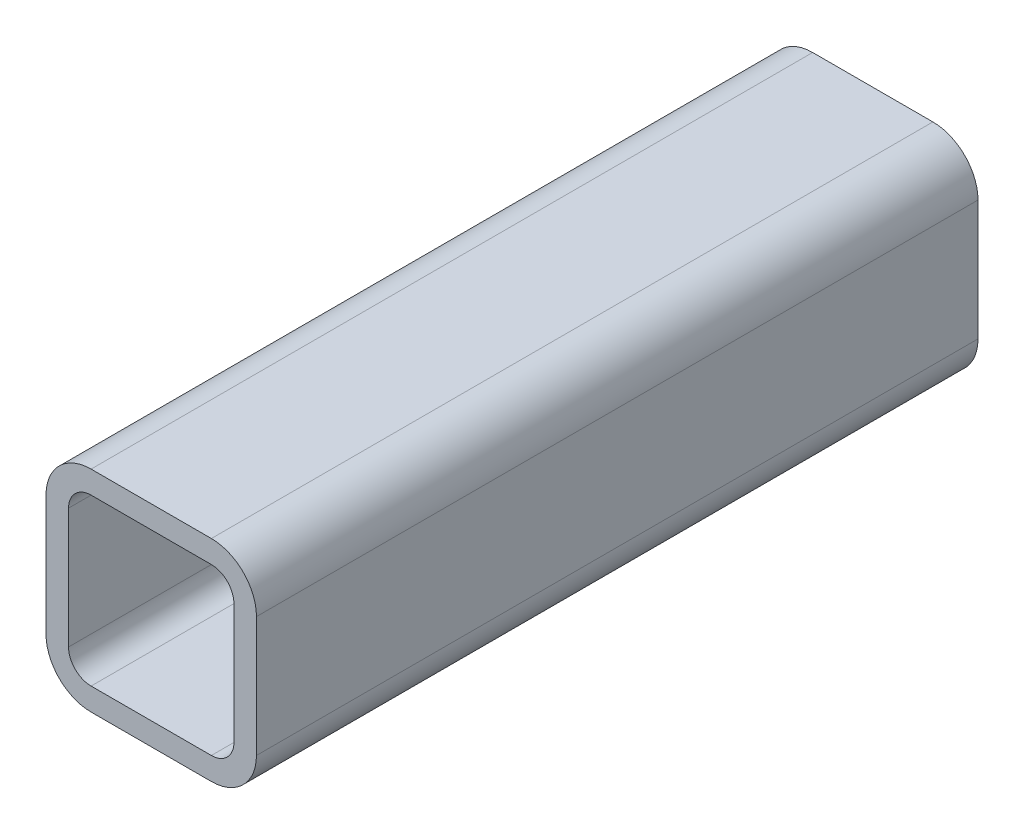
ISO-10303-21;
HEADER;
FILE_DESCRIPTION(('STEP AP214'),'2;1');
FILE_NAME('part.step','',(''),(''),'','','');
FILE_SCHEMA(('AUTOMOTIVE_DESIGN { 1 0 10303 214 1 1 1 1 }'));
ENDSEC;
DATA;
#1=APPLICATION_CONTEXT('core data for automotive mechanical design processes');
#2=APPLICATION_PROTOCOL_DEFINITION('international standard','automotive_design',2000,#1);
#3=PRODUCT_CONTEXT('',#1,'mechanical');
#4=PRODUCT('Part','Part','',(#3));
#5=PRODUCT_RELATED_PRODUCT_CATEGORY('part','',(#4));
#6=PRODUCT_DEFINITION_FORMATION('','',#4);
#7=PRODUCT_DEFINITION_CONTEXT('part definition',#1,'design');
#8=PRODUCT_DEFINITION('design','',#6,#7);
#9=PRODUCT_DEFINITION_SHAPE('','',#8);
#10=(LENGTH_UNIT() NAMED_UNIT(*) SI_UNIT(.MILLI.,.METRE.));
#11=(NAMED_UNIT(*) PLANE_ANGLE_UNIT() SI_UNIT($,.RADIAN.));
#12=(NAMED_UNIT(*) SI_UNIT($,.STERADIAN.) SOLID_ANGLE_UNIT());
#13=UNCERTAINTY_MEASURE_WITH_UNIT(LENGTH_MEASURE(1.E-05),#10,'distance_accuracy_value','');
#14=(GEOMETRIC_REPRESENTATION_CONTEXT(3) GLOBAL_UNCERTAINTY_ASSIGNED_CONTEXT((#13)) GLOBAL_UNIT_ASSIGNED_CONTEXT((#10,
#11,#12)) REPRESENTATION_CONTEXT('',''));
#15=CARTESIAN_POINT('',(0.,0.,0.));
#16=DIRECTION('',(0.,0.,1.));
#17=DIRECTION('',(1.,0.,0.));
#18=AXIS2_PLACEMENT_3D('',#15,#16,#17);
#19=CARTESIAN_POINT('',(21.1321469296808,70.6515103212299,304.8));
#20=DIRECTION('',(0.,0.,1.));
#21=DIRECTION('',(1.,0.,0.));
#22=AXIS2_PLACEMENT_3D('',#19,#20,#21);
#23=PLANE('',#22);
#24=CARTESIAN_POINT('',(21.1321469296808,70.6515103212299,304.8));
#25=DIRECTION('',(0.,0.,1.));
#26=DIRECTION('',(1.,0.,0.));
#27=AXIS2_PLACEMENT_3D('',#24,#25,#26);
#28=CIRCLE('',#27,19.05);
#29=CARTESIAN_POINT('',(21.1321469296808,89.7015103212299,304.8));
#30=VERTEX_POINT('',#29);
#31=CARTESIAN_POINT('',(2.08214692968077,70.6515103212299,304.8));
#32=VERTEX_POINT('',#31);
#33=EDGE_CURVE('E211',#30,#32,#28,.T.);
#34=ORIENTED_EDGE('',*,*,#33,.T.);
#35=DIRECTION('',(0.,-1.,0.));
#36=VECTOR('',#35,1.);
#37=CARTESIAN_POINT('',(2.08214692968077,70.6515103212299,304.8));
#38=LINE('',#37,#36);
#39=CARTESIAN_POINT('',(2.08214692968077,19.8515103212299,304.8));
#40=VERTEX_POINT('',#39);
#41=EDGE_CURVE('E214',#32,#40,#38,.T.);
#42=ORIENTED_EDGE('',*,*,#41,.T.);
#43=CARTESIAN_POINT('',(21.1321469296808,19.8515103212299,304.8));
#44=DIRECTION('',(0.,0.,1.));
#45=DIRECTION('',(1.,0.,0.));
#46=AXIS2_PLACEMENT_3D('',#43,#44,#45);
#47=CIRCLE('',#46,19.05);
#48=CARTESIAN_POINT('',(21.1321469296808,0.801510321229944,304.8));
#49=VERTEX_POINT('',#48);
#50=EDGE_CURVE('E217',#40,#49,#47,.T.);
#51=ORIENTED_EDGE('',*,*,#50,.T.);
#52=DIRECTION('',(1.,0.,0.));
#53=VECTOR('',#52,1.);
#54=CARTESIAN_POINT('',(21.1321469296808,0.801510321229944,304.8));
#55=LINE('',#54,#53);
#56=CARTESIAN_POINT('',(71.9321469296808,0.801510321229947,304.8));
#57=VERTEX_POINT('',#56);
#58=EDGE_CURVE('E219',#49,#57,#55,.T.);
#59=ORIENTED_EDGE('',*,*,#58,.T.);
#60=CARTESIAN_POINT('',(71.9321469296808,19.8515103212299,304.8));
#61=DIRECTION('',(0.,0.,1.));
#62=DIRECTION('',(1.,0.,0.));
#63=AXIS2_PLACEMENT_3D('',#60,#61,#62);
#64=CIRCLE('',#63,19.05);
#65=CARTESIAN_POINT('',(90.9821469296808,19.8515103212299,304.8));
#66=VERTEX_POINT('',#65);
#67=EDGE_CURVE('E221',#57,#66,#64,.T.);
#68=ORIENTED_EDGE('',*,*,#67,.T.);
#69=DIRECTION('',(0.,1.,0.));
#70=VECTOR('',#69,1.);
#71=CARTESIAN_POINT('',(90.9821469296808,19.8515103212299,304.8));
#72=LINE('',#71,#70);
#73=CARTESIAN_POINT('',(90.9821469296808,70.6515103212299,304.8));
#74=VERTEX_POINT('',#73);
#75=EDGE_CURVE('E223',#66,#74,#72,.T.);
#76=ORIENTED_EDGE('',*,*,#75,.T.);
#77=CARTESIAN_POINT('',(71.9321469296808,70.6515103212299,304.8));
#78=DIRECTION('',(0.,0.,1.));
#79=DIRECTION('',(1.,0.,0.));
#80=AXIS2_PLACEMENT_3D('',#77,#78,#79);
#81=CIRCLE('',#80,19.05);
#82=CARTESIAN_POINT('',(71.9321469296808,89.7015103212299,304.8));
#83=VERTEX_POINT('',#82);
#84=EDGE_CURVE('E225',#74,#83,#81,.T.);
#85=ORIENTED_EDGE('',*,*,#84,.T.);
#86=DIRECTION('',(-1.,0.,0.));
#87=VECTOR('',#86,1.);
#88=CARTESIAN_POINT('',(71.9321469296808,89.7015103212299,304.8));
#89=LINE('',#88,#87);
#90=EDGE_CURVE('E227',#83,#30,#89,.T.);
#91=ORIENTED_EDGE('',*,*,#90,.T.);
#92=EDGE_LOOP('',(#34,#42,#51,#59,#68,#76,#85,#91));
#93=FACE_BOUND('',#92,.T.);
#94=DIRECTION('',(0.,-1.,0.));
#95=VECTOR('',#94,1.);
#96=CARTESIAN_POINT('',(11.6071469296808,19.8515103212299,304.8));
#97=LINE('',#96,#95);
#98=CARTESIAN_POINT('',(11.6071469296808,70.6515103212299,304.8));
#99=VERTEX_POINT('',#98);
#100=CARTESIAN_POINT('',(11.6071469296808,19.8515103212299,304.8));
#101=VERTEX_POINT('',#100);
#102=EDGE_CURVE('E154',#99,#101,#97,.T.);
#103=ORIENTED_EDGE('',*,*,#102,.F.);
#104=CARTESIAN_POINT('',(21.1321469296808,70.6515103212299,304.8));
#105=DIRECTION('',(0.,0.,1.));
#106=DIRECTION('',(1.,0.,0.));
#107=AXIS2_PLACEMENT_3D('',#104,#105,#106);
#108=CIRCLE('',#107,9.525);
#109=CARTESIAN_POINT('',(21.1321469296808,80.1765103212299,304.8));
#110=VERTEX_POINT('',#109);
#111=EDGE_CURVE('E146',#110,#99,#108,.T.);
#112=ORIENTED_EDGE('',*,*,#111,.F.);
#113=DIRECTION('',(-1.,0.,0.));
#114=VECTOR('',#113,1.);
#115=CARTESIAN_POINT('',(21.1321469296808,80.1765103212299,304.8));
#116=LINE('',#115,#114);
#117=CARTESIAN_POINT('',(71.9321469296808,80.1765103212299,304.8));
#118=VERTEX_POINT('',#117);
#119=EDGE_CURVE('E179',#118,#110,#116,.T.);
#120=ORIENTED_EDGE('',*,*,#119,.F.);
#121=CARTESIAN_POINT('',(71.9321469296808,70.6515103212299,304.8));
#122=DIRECTION('',(0.,0.,1.));
#123=DIRECTION('',(1.,0.,0.));
#124=AXIS2_PLACEMENT_3D('',#121,#122,#123);
#125=CIRCLE('',#124,9.52499999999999);
#126=CARTESIAN_POINT('',(81.4571469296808,70.6515103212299,304.8));
#127=VERTEX_POINT('',#126);
#128=EDGE_CURVE('E177',#127,#118,#125,.T.);
#129=ORIENTED_EDGE('',*,*,#128,.F.);
#130=DIRECTION('',(0.,1.,0.));
#131=VECTOR('',#130,1.);
#132=CARTESIAN_POINT('',(81.4571469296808,70.6515103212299,304.8));
#133=LINE('',#132,#131);
#134=CARTESIAN_POINT('',(81.4571469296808,19.8515103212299,304.8));
#135=VERTEX_POINT('',#134);
#136=EDGE_CURVE('E175',#135,#127,#133,.T.);
#137=ORIENTED_EDGE('',*,*,#136,.F.);
#138=CARTESIAN_POINT('',(71.9321469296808,19.8515103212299,304.8));
#139=DIRECTION('',(0.,0.,1.));
#140=DIRECTION('',(1.,0.,0.));
#141=AXIS2_PLACEMENT_3D('',#138,#139,#140);
#142=CIRCLE('',#141,9.525);
#143=CARTESIAN_POINT('',(71.9321469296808,10.32651032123,304.8));
#144=VERTEX_POINT('',#143);
#145=EDGE_CURVE('E173',#144,#135,#142,.T.);
#146=ORIENTED_EDGE('',*,*,#145,.F.);
#147=DIRECTION('',(1.,0.,0.));
#148=VECTOR('',#147,1.);
#149=CARTESIAN_POINT('',(71.9321469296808,10.3265103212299,304.8));
#150=LINE('',#149,#148);
#151=CARTESIAN_POINT('',(21.1321469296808,10.3265103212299,304.8));
#152=VERTEX_POINT('',#151);
#153=EDGE_CURVE('E169',#152,#144,#150,.T.);
#154=ORIENTED_EDGE('',*,*,#153,.F.);
#155=CARTESIAN_POINT('',(21.1321469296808,19.8515103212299,304.8));
#156=DIRECTION('',(0.,0.,1.));
#157=DIRECTION('',(1.,0.,0.));
#158=AXIS2_PLACEMENT_3D('',#155,#156,#157);
#159=CIRCLE('',#158,9.525);
#160=EDGE_CURVE('E167',#101,#152,#159,.T.);
#161=ORIENTED_EDGE('',*,*,#160,.F.);
#162=EDGE_LOOP('',(#103,#112,#120,#129,#137,#146,#154,#161));
#163=FACE_BOUND('',#162,.T.);
#164=ADVANCED_FACE('F33',(#93,#163),#23,.T.);
#165=CARTESIAN_POINT('',(21.1321469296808,70.6515103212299,0.));
#166=DIRECTION('',(0.,0.,1.));
#167=DIRECTION('',(1.,0.,0.));
#168=AXIS2_PLACEMENT_3D('',#165,#166,#167);
#169=PLANE('',#168);
#170=CARTESIAN_POINT('',(21.1321469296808,70.6515103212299,0.));
#171=DIRECTION('',(0.,0.,1.));
#172=DIRECTION('',(1.,0.,0.));
#173=AXIS2_PLACEMENT_3D('',#170,#171,#172);
#174=CIRCLE('',#173,19.05);
#175=CARTESIAN_POINT('',(21.1321469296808,89.7015103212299,0.));
#176=VERTEX_POINT('',#175);
#177=CARTESIAN_POINT('',(2.08214692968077,70.6515103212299,0.));
#178=VERTEX_POINT('',#177);
#179=EDGE_CURVE('E162',#176,#178,#174,.T.);
#180=ORIENTED_EDGE('',*,*,#179,.F.);
#181=DIRECTION('',(-1.,0.,0.));
#182=VECTOR('',#181,1.);
#183=CARTESIAN_POINT('',(71.9321469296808,89.7015103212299,0.));
#184=LINE('',#183,#182);
#185=CARTESIAN_POINT('',(71.9321469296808,89.7015103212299,0.));
#186=VERTEX_POINT('',#185);
#187=EDGE_CURVE('E215',#186,#176,#184,.T.);
#188=ORIENTED_EDGE('',*,*,#187,.F.);
#189=CARTESIAN_POINT('',(71.9321469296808,70.6515103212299,0.));
#190=DIRECTION('',(0.,0.,1.));
#191=DIRECTION('',(1.,0.,0.));
#192=AXIS2_PLACEMENT_3D('',#189,#190,#191);
#193=CIRCLE('',#192,19.05);
#194=CARTESIAN_POINT('',(90.9821469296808,70.6515103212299,0.));
#195=VERTEX_POINT('',#194);
#196=EDGE_CURVE('E242',#195,#186,#193,.T.);
#197=ORIENTED_EDGE('',*,*,#196,.F.);
#198=DIRECTION('',(0.,1.,0.));
#199=VECTOR('',#198,1.);
#200=CARTESIAN_POINT('',(90.9821469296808,19.8515103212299,0.));
#201=LINE('',#200,#199);
#202=CARTESIAN_POINT('',(90.9821469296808,19.8515103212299,0.));
#203=VERTEX_POINT('',#202);
#204=EDGE_CURVE('E240',#203,#195,#201,.T.);
#205=ORIENTED_EDGE('',*,*,#204,.F.);
#206=CARTESIAN_POINT('',(71.9321469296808,19.8515103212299,0.));
#207=DIRECTION('',(0.,0.,1.));
#208=DIRECTION('',(1.,0.,0.));
#209=AXIS2_PLACEMENT_3D('',#206,#207,#208);
#210=CIRCLE('',#209,19.05);
#211=CARTESIAN_POINT('',(71.9321469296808,0.801510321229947,0.));
#212=VERTEX_POINT('',#211);
#213=EDGE_CURVE('E238',#212,#203,#210,.T.);
#214=ORIENTED_EDGE('',*,*,#213,.F.);
#215=DIRECTION('',(1.,0.,0.));
#216=VECTOR('',#215,1.);
#217=CARTESIAN_POINT('',(21.1321469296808,0.801510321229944,0.));
#218=LINE('',#217,#216);
#219=CARTESIAN_POINT('',(21.1321469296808,0.801510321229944,0.));
#220=VERTEX_POINT('',#219);
#221=EDGE_CURVE('E236',#220,#212,#218,.T.);
#222=ORIENTED_EDGE('',*,*,#221,.F.);
#223=CARTESIAN_POINT('',(21.1321469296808,19.8515103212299,0.));
#224=DIRECTION('',(0.,0.,1.));
#225=DIRECTION('',(1.,0.,0.));
#226=AXIS2_PLACEMENT_3D('',#223,#224,#225);
#227=CIRCLE('',#226,19.05);
#228=CARTESIAN_POINT('',(2.08214692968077,19.8515103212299,0.));
#229=VERTEX_POINT('',#228);
#230=EDGE_CURVE('E234',#229,#220,#227,.T.);
#231=ORIENTED_EDGE('',*,*,#230,.F.);
#232=DIRECTION('',(0.,-1.,0.));
#233=VECTOR('',#232,1.);
#234=CARTESIAN_POINT('',(2.08214692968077,70.6515103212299,0.));
#235=LINE('',#234,#233);
#236=EDGE_CURVE('E232',#178,#229,#235,.T.);
#237=ORIENTED_EDGE('',*,*,#236,.F.);
#238=EDGE_LOOP('',(#180,#188,#197,#205,#214,#222,#231,#237));
#239=FACE_BOUND('',#238,.T.);
#240=CARTESIAN_POINT('',(21.1321469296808,70.6515103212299,0.));
#241=DIRECTION('',(0.,0.,1.));
#242=DIRECTION('',(1.,0.,0.));
#243=AXIS2_PLACEMENT_3D('',#240,#241,#242);
#244=CIRCLE('',#243,9.525);
#245=CARTESIAN_POINT('',(21.1321469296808,80.1765103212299,0.));
#246=VERTEX_POINT('',#245);
#247=CARTESIAN_POINT('',(11.6071469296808,70.6515103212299,0.));
#248=VERTEX_POINT('',#247);
#249=EDGE_CURVE('E56',#246,#248,#244,.T.);
#250=ORIENTED_EDGE('',*,*,#249,.T.);
#251=DIRECTION('',(0.,-1.,0.));
#252=VECTOR('',#251,1.);
#253=CARTESIAN_POINT('',(11.6071469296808,19.8515103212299,0.));
#254=LINE('',#253,#252);
#255=CARTESIAN_POINT('',(11.6071469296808,19.8515103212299,0.));
#256=VERTEX_POINT('',#255);
#257=EDGE_CURVE('E161',#248,#256,#254,.T.);
#258=ORIENTED_EDGE('',*,*,#257,.T.);
#259=CARTESIAN_POINT('',(21.1321469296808,19.8515103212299,0.));
#260=DIRECTION('',(0.,0.,1.));
#261=DIRECTION('',(1.,0.,0.));
#262=AXIS2_PLACEMENT_3D('',#259,#260,#261);
#263=CIRCLE('',#262,9.525);
#264=CARTESIAN_POINT('',(21.1321469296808,10.3265103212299,0.));
#265=VERTEX_POINT('',#264);
#266=EDGE_CURVE('E183',#256,#265,#263,.T.);
#267=ORIENTED_EDGE('',*,*,#266,.T.);
#268=DIRECTION('',(1.,0.,0.));
#269=VECTOR('',#268,1.);
#270=CARTESIAN_POINT('',(71.9321469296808,10.3265103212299,0.));
#271=LINE('',#270,#269);
#272=CARTESIAN_POINT('',(71.9321469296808,10.32651032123,0.));
#273=VERTEX_POINT('',#272);
#274=EDGE_CURVE('E186',#265,#273,#271,.T.);
#275=ORIENTED_EDGE('',*,*,#274,.T.);
#276=CARTESIAN_POINT('',(71.9321469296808,19.8515103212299,0.));
#277=DIRECTION('',(0.,0.,1.));
#278=DIRECTION('',(1.,0.,0.));
#279=AXIS2_PLACEMENT_3D('',#276,#277,#278);
#280=CIRCLE('',#279,9.525);
#281=CARTESIAN_POINT('',(81.4571469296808,19.8515103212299,0.));
#282=VERTEX_POINT('',#281);
#283=EDGE_CURVE('E189',#273,#282,#280,.T.);
#284=ORIENTED_EDGE('',*,*,#283,.T.);
#285=DIRECTION('',(0.,1.,0.));
#286=VECTOR('',#285,1.);
#287=CARTESIAN_POINT('',(81.4571469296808,70.6515103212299,0.));
#288=LINE('',#287,#286);
#289=CARTESIAN_POINT('',(81.4571469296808,70.6515103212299,0.));
#290=VERTEX_POINT('',#289);
#291=EDGE_CURVE('E192',#282,#290,#288,.T.);
#292=ORIENTED_EDGE('',*,*,#291,.T.);
#293=CARTESIAN_POINT('',(71.9321469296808,70.6515103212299,0.));
#294=DIRECTION('',(0.,0.,1.));
#295=DIRECTION('',(1.,0.,0.));
#296=AXIS2_PLACEMENT_3D('',#293,#294,#295);
#297=CIRCLE('',#296,9.52499999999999);
#298=CARTESIAN_POINT('',(71.9321469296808,80.1765103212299,0.));
#299=VERTEX_POINT('',#298);
#300=EDGE_CURVE('E195',#290,#299,#297,.T.);
#301=ORIENTED_EDGE('',*,*,#300,.T.);
#302=DIRECTION('',(-1.,0.,0.));
#303=VECTOR('',#302,1.);
#304=CARTESIAN_POINT('',(21.1321469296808,80.1765103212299,0.));
#305=LINE('',#304,#303);
#306=EDGE_CURVE('E155',#299,#246,#305,.T.);
#307=ORIENTED_EDGE('',*,*,#306,.T.);
#308=EDGE_LOOP('',(#250,#258,#267,#275,#284,#292,#301,#307));
#309=FACE_BOUND('',#308,.T.);
#310=ADVANCED_FACE('F272',(#239,#309),#169,.F.);
#311=CARTESIAN_POINT('',(21.1321469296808,70.6515103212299,304.8));
#312=DIRECTION('',(0.,0.,-1.));
#313=DIRECTION('',(-1.,0.,0.));
#314=AXIS2_PLACEMENT_3D('',#311,#312,#313);
#315=CYLINDRICAL_SURFACE('',#314,19.05);
#316=ORIENTED_EDGE('',*,*,#179,.T.);
#317=DIRECTION('',(0.,0.,-1.));
#318=VECTOR('',#317,1.);
#319=CARTESIAN_POINT('',(2.08214692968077,70.6515103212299,304.8));
#320=LINE('',#319,#318);
#321=EDGE_CURVE('E11',#32,#178,#320,.T.);
#322=ORIENTED_EDGE('',*,*,#321,.F.);
#323=ORIENTED_EDGE('',*,*,#33,.F.);
#324=DIRECTION('',(0.,0.,-1.));
#325=VECTOR('',#324,1.);
#326=CARTESIAN_POINT('',(21.1321469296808,89.7015103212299,304.8));
#327=LINE('',#326,#325);
#328=EDGE_CURVE('E229',#30,#176,#327,.T.);
#329=ORIENTED_EDGE('',*,*,#328,.T.);
#330=EDGE_LOOP('',(#316,#322,#323,#329));
#331=FACE_BOUND('',#330,.T.);
#332=ADVANCED_FACE('F35',(#331),#315,.T.);
#333=CARTESIAN_POINT('',(2.08214692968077,70.6515103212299,304.8));
#334=DIRECTION('',(1.,0.,0.));
#335=DIRECTION('',(0.,0.,-1.));
#336=AXIS2_PLACEMENT_3D('',#333,#334,#335);
#337=PLANE('',#336);
#338=ORIENTED_EDGE('',*,*,#236,.T.);
#339=DIRECTION('',(0.,0.,-1.));
#340=VECTOR('',#339,1.);
#341=CARTESIAN_POINT('',(2.08214692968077,19.8515103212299,304.8));
#342=LINE('',#341,#340);
#343=EDGE_CURVE('E41',#40,#229,#342,.T.);
#344=ORIENTED_EDGE('',*,*,#343,.F.);
#345=ORIENTED_EDGE('',*,*,#41,.F.);
#346=ORIENTED_EDGE('',*,*,#321,.T.);
#347=EDGE_LOOP('',(#338,#344,#345,#346));
#348=FACE_BOUND('',#347,.T.);
#349=ADVANCED_FACE('F289',(#348),#337,.F.);
#350=CARTESIAN_POINT('',(21.1321469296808,19.8515103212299,304.8));
#351=DIRECTION('',(0.,0.,-1.));
#352=DIRECTION('',(-1.,0.,0.));
#353=AXIS2_PLACEMENT_3D('',#350,#351,#352);
#354=CYLINDRICAL_SURFACE('',#353,19.05);
#355=ORIENTED_EDGE('',*,*,#230,.T.);
#356=DIRECTION('',(0.,0.,-1.));
#357=VECTOR('',#356,1.);
#358=CARTESIAN_POINT('',(21.1321469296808,0.801510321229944,304.8));
#359=LINE('',#358,#357);
#360=EDGE_CURVE('E259',#49,#220,#359,.T.);
#361=ORIENTED_EDGE('',*,*,#360,.F.);
#362=ORIENTED_EDGE('',*,*,#50,.F.);
#363=ORIENTED_EDGE('',*,*,#343,.T.);
#364=EDGE_LOOP('',(#355,#361,#362,#363));
#365=FACE_BOUND('',#364,.T.);
#366=ADVANCED_FACE('F266',(#365),#354,.T.);
#367=CARTESIAN_POINT('',(21.1321469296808,0.801510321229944,304.8));
#368=DIRECTION('',(0.,1.,0.));
#369=DIRECTION('',(0.,0.,1.));
#370=AXIS2_PLACEMENT_3D('',#367,#368,#369);
#371=PLANE('',#370);
#372=ORIENTED_EDGE('',*,*,#221,.T.);
#373=DIRECTION('',(0.,0.,-1.));
#374=VECTOR('',#373,1.);
#375=CARTESIAN_POINT('',(71.9321469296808,0.801510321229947,304.8));
#376=LINE('',#375,#374);
#377=EDGE_CURVE('E256',#57,#212,#376,.T.);
#378=ORIENTED_EDGE('',*,*,#377,.F.);
#379=ORIENTED_EDGE('',*,*,#58,.F.);
#380=ORIENTED_EDGE('',*,*,#360,.T.);
#381=EDGE_LOOP('',(#372,#378,#379,#380));
#382=FACE_BOUND('',#381,.T.);
#383=ADVANCED_FACE('F278',(#382),#371,.F.);
#384=CARTESIAN_POINT('',(71.9321469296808,19.8515103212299,304.8));
#385=DIRECTION('',(0.,0.,-1.));
#386=DIRECTION('',(-1.,0.,0.));
#387=AXIS2_PLACEMENT_3D('',#384,#385,#386);
#388=CYLINDRICAL_SURFACE('',#387,19.05);
#389=ORIENTED_EDGE('',*,*,#213,.T.);
#390=DIRECTION('',(0.,0.,-1.));
#391=VECTOR('',#390,1.);
#392=CARTESIAN_POINT('',(90.9821469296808,19.8515103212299,304.8));
#393=LINE('',#392,#391);
#394=EDGE_CURVE('E253',#66,#203,#393,.T.);
#395=ORIENTED_EDGE('',*,*,#394,.F.);
#396=ORIENTED_EDGE('',*,*,#67,.F.);
#397=ORIENTED_EDGE('',*,*,#377,.T.);
#398=EDGE_LOOP('',(#389,#395,#396,#397));
#399=FACE_BOUND('',#398,.T.);
#400=ADVANCED_FACE('F282',(#399),#388,.T.);
#401=CARTESIAN_POINT('',(90.9821469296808,19.8515103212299,304.8));
#402=DIRECTION('',(-1.,0.,0.));
#403=DIRECTION('',(0.,0.,1.));
#404=AXIS2_PLACEMENT_3D('',#401,#402,#403);
#405=PLANE('',#404);
#406=ORIENTED_EDGE('',*,*,#204,.T.);
#407=DIRECTION('',(0.,0.,-1.));
#408=VECTOR('',#407,1.);
#409=CARTESIAN_POINT('',(90.9821469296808,70.6515103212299,304.8));
#410=LINE('',#409,#408);
#411=EDGE_CURVE('E250',#74,#195,#410,.T.);
#412=ORIENTED_EDGE('',*,*,#411,.F.);
#413=ORIENTED_EDGE('',*,*,#75,.F.);
#414=ORIENTED_EDGE('',*,*,#394,.T.);
#415=EDGE_LOOP('',(#406,#412,#413,#414));
#416=FACE_BOUND('',#415,.T.);
#417=ADVANCED_FACE('F302',(#416),#405,.F.);
#418=CARTESIAN_POINT('',(71.9321469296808,70.6515103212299,304.8));
#419=DIRECTION('',(0.,0.,-1.));
#420=DIRECTION('',(-1.,0.,0.));
#421=AXIS2_PLACEMENT_3D('',#418,#419,#420);
#422=CYLINDRICAL_SURFACE('',#421,19.05);
#423=ORIENTED_EDGE('',*,*,#196,.T.);
#424=DIRECTION('',(0.,0.,-1.));
#425=VECTOR('',#424,1.);
#426=CARTESIAN_POINT('',(71.9321469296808,89.7015103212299,304.8));
#427=LINE('',#426,#425);
#428=EDGE_CURVE('E247',#83,#186,#427,.T.);
#429=ORIENTED_EDGE('',*,*,#428,.F.);
#430=ORIENTED_EDGE('',*,*,#84,.F.);
#431=ORIENTED_EDGE('',*,*,#411,.T.);
#432=EDGE_LOOP('',(#423,#429,#430,#431));
#433=FACE_BOUND('',#432,.T.);
#434=ADVANCED_FACE('F300',(#433),#422,.T.);
#435=CARTESIAN_POINT('',(71.9321469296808,89.7015103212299,304.8));
#436=DIRECTION('',(0.,-1.,0.));
#437=DIRECTION('',(0.,0.,-1.));
#438=AXIS2_PLACEMENT_3D('',#435,#436,#437);
#439=PLANE('',#438);
#440=ORIENTED_EDGE('',*,*,#187,.T.);
#441=ORIENTED_EDGE('',*,*,#328,.F.);
#442=ORIENTED_EDGE('',*,*,#90,.F.);
#443=ORIENTED_EDGE('',*,*,#428,.T.);
#444=EDGE_LOOP('',(#440,#441,#442,#443));
#445=FACE_BOUND('',#444,.T.);
#446=ADVANCED_FACE('F295',(#445),#439,.F.);
#447=CARTESIAN_POINT('',(21.1321469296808,70.6515103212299,304.8));
#448=DIRECTION('',(0.,0.,-1.));
#449=DIRECTION('',(-1.,0.,0.));
#450=AXIS2_PLACEMENT_3D('',#447,#448,#449);
#451=CYLINDRICAL_SURFACE('',#450,9.525);
#452=ORIENTED_EDGE('',*,*,#249,.F.);
#453=DIRECTION('',(0.,0.,-1.));
#454=VECTOR('',#453,1.);
#455=CARTESIAN_POINT('',(21.1321469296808,80.1765103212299,304.8));
#456=LINE('',#455,#454);
#457=EDGE_CURVE('E150',#110,#246,#456,.T.);
#458=ORIENTED_EDGE('',*,*,#457,.F.);
#459=ORIENTED_EDGE('',*,*,#111,.T.);
#460=DIRECTION('',(0.,0.,-1.));
#461=VECTOR('',#460,1.);
#462=CARTESIAN_POINT('',(11.6071469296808,70.6515103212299,304.8));
#463=LINE('',#462,#461);
#464=EDGE_CURVE('E149',#99,#248,#463,.T.);
#465=ORIENTED_EDGE('',*,*,#464,.T.);
#466=EDGE_LOOP('',(#452,#458,#459,#465));
#467=FACE_BOUND('',#466,.T.);
#468=ADVANCED_FACE('F148',(#467),#451,.F.);
#469=CARTESIAN_POINT('',(11.6071469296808,19.8515103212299,304.8));
#470=DIRECTION('',(1.,0.,0.));
#471=DIRECTION('',(0.,0.,-1.));
#472=AXIS2_PLACEMENT_3D('',#469,#470,#471);
#473=PLANE('',#472);
#474=ORIENTED_EDGE('',*,*,#257,.F.);
#475=ORIENTED_EDGE('',*,*,#464,.F.);
#476=ORIENTED_EDGE('',*,*,#102,.T.);
#477=DIRECTION('',(0.,0.,-1.));
#478=VECTOR('',#477,1.);
#479=CARTESIAN_POINT('',(11.6071469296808,19.8515103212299,304.8));
#480=LINE('',#479,#478);
#481=EDGE_CURVE('E163',#101,#256,#480,.T.);
#482=ORIENTED_EDGE('',*,*,#481,.T.);
#483=EDGE_LOOP('',(#474,#475,#476,#482));
#484=FACE_BOUND('',#483,.T.);
#485=ADVANCED_FACE('F158',(#484),#473,.T.);
#486=CARTESIAN_POINT('',(21.1321469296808,19.8515103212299,304.8));
#487=DIRECTION('',(0.,0.,-1.));
#488=DIRECTION('',(-1.,0.,0.));
#489=AXIS2_PLACEMENT_3D('',#486,#487,#488);
#490=CYLINDRICAL_SURFACE('',#489,9.525);
#491=ORIENTED_EDGE('',*,*,#266,.F.);
#492=ORIENTED_EDGE('',*,*,#481,.F.);
#493=ORIENTED_EDGE('',*,*,#160,.T.);
#494=DIRECTION('',(0.,0.,-1.));
#495=VECTOR('',#494,1.);
#496=CARTESIAN_POINT('',(21.1321469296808,10.3265103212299,304.8));
#497=LINE('',#496,#495);
#498=EDGE_CURVE('E208',#152,#265,#497,.T.);
#499=ORIENTED_EDGE('',*,*,#498,.T.);
#500=EDGE_LOOP('',(#491,#492,#493,#499));
#501=FACE_BOUND('',#500,.T.);
#502=ADVANCED_FACE('F327',(#501),#490,.F.);
#503=CARTESIAN_POINT('',(71.9321469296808,10.3265103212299,304.8));
#504=DIRECTION('',(0.,1.,0.));
#505=DIRECTION('',(0.,0.,1.));
#506=AXIS2_PLACEMENT_3D('',#503,#504,#505);
#507=PLANE('',#506);
#508=ORIENTED_EDGE('',*,*,#274,.F.);
#509=ORIENTED_EDGE('',*,*,#498,.F.);
#510=ORIENTED_EDGE('',*,*,#153,.T.);
#511=DIRECTION('',(0.,0.,-1.));
#512=VECTOR('',#511,1.);
#513=CARTESIAN_POINT('',(71.9321469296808,10.32651032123,304.8));
#514=LINE('',#513,#512);
#515=EDGE_CURVE('E206',#144,#273,#514,.T.);
#516=ORIENTED_EDGE('',*,*,#515,.T.);
#517=EDGE_LOOP('',(#508,#509,#510,#516));
#518=FACE_BOUND('',#517,.T.);
#519=ADVANCED_FACE('F331',(#518),#507,.T.);
#520=CARTESIAN_POINT('',(71.9321469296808,19.8515103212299,304.8));
#521=DIRECTION('',(0.,0.,-1.));
#522=DIRECTION('',(-1.,0.,0.));
#523=AXIS2_PLACEMENT_3D('',#520,#521,#522);
#524=CYLINDRICAL_SURFACE('',#523,9.525);
#525=ORIENTED_EDGE('',*,*,#283,.F.);
#526=ORIENTED_EDGE('',*,*,#515,.F.);
#527=ORIENTED_EDGE('',*,*,#145,.T.);
#528=DIRECTION('',(0.,0.,-1.));
#529=VECTOR('',#528,1.);
#530=CARTESIAN_POINT('',(81.4571469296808,19.8515103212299,304.8));
#531=LINE('',#530,#529);
#532=EDGE_CURVE('E204',#135,#282,#531,.T.);
#533=ORIENTED_EDGE('',*,*,#532,.T.);
#534=EDGE_LOOP('',(#525,#526,#527,#533));
#535=FACE_BOUND('',#534,.T.);
#536=ADVANCED_FACE('F337',(#535),#524,.F.);
#537=CARTESIAN_POINT('',(81.4571469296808,70.6515103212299,304.8));
#538=DIRECTION('',(-1.,0.,0.));
#539=DIRECTION('',(0.,0.,1.));
#540=AXIS2_PLACEMENT_3D('',#537,#538,#539);
#541=PLANE('',#540);
#542=ORIENTED_EDGE('',*,*,#291,.F.);
#543=ORIENTED_EDGE('',*,*,#532,.F.);
#544=ORIENTED_EDGE('',*,*,#136,.T.);
#545=DIRECTION('',(0.,0.,-1.));
#546=VECTOR('',#545,1.);
#547=CARTESIAN_POINT('',(81.4571469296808,70.6515103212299,304.8));
#548=LINE('',#547,#546);
#549=EDGE_CURVE('E202',#127,#290,#548,.T.);
#550=ORIENTED_EDGE('',*,*,#549,.T.);
#551=EDGE_LOOP('',(#542,#543,#544,#550));
#552=FACE_BOUND('',#551,.T.);
#553=ADVANCED_FACE('F341',(#552),#541,.T.);
#554=CARTESIAN_POINT('',(71.9321469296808,70.6515103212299,304.8));
#555=DIRECTION('',(0.,0.,-1.));
#556=DIRECTION('',(-1.,0.,0.));
#557=AXIS2_PLACEMENT_3D('',#554,#555,#556);
#558=CYLINDRICAL_SURFACE('',#557,9.52499999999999);
#559=ORIENTED_EDGE('',*,*,#300,.F.);
#560=ORIENTED_EDGE('',*,*,#549,.F.);
#561=ORIENTED_EDGE('',*,*,#128,.T.);
#562=DIRECTION('',(0.,0.,-1.));
#563=VECTOR('',#562,1.);
#564=CARTESIAN_POINT('',(71.9321469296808,80.1765103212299,304.8));
#565=LINE('',#564,#563);
#566=EDGE_CURVE('E48',#118,#299,#565,.T.);
#567=ORIENTED_EDGE('',*,*,#566,.T.);
#568=EDGE_LOOP('',(#559,#560,#561,#567));
#569=FACE_BOUND('',#568,.T.);
#570=ADVANCED_FACE('F345',(#569),#558,.F.);
#571=CARTESIAN_POINT('',(21.1321469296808,80.1765103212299,304.8));
#572=DIRECTION('',(0.,-1.,0.));
#573=DIRECTION('',(0.,0.,-1.));
#574=AXIS2_PLACEMENT_3D('',#571,#572,#573);
#575=PLANE('',#574);
#576=ORIENTED_EDGE('',*,*,#306,.F.);
#577=ORIENTED_EDGE('',*,*,#566,.F.);
#578=ORIENTED_EDGE('',*,*,#119,.T.);
#579=ORIENTED_EDGE('',*,*,#457,.T.);
#580=EDGE_LOOP('',(#576,#577,#578,#579));
#581=FACE_BOUND('',#580,.T.);
#582=ADVANCED_FACE('F349',(#581),#575,.T.);
#583=CLOSED_SHELL('',(#164,#310,#332,#349,#366,#383,#400,#417,#434,#446,#468,#485,#502,#519,
#536,#553,#570,#582));
#584=MANIFOLD_SOLID_BREP('B2',#583);
#585=ADVANCED_BREP_SHAPE_REPRESENTATION('',(#18,#584),#14);
#586=SHAPE_DEFINITION_REPRESENTATION(#9,#585);
ENDSEC;
END-ISO-10303-21;
